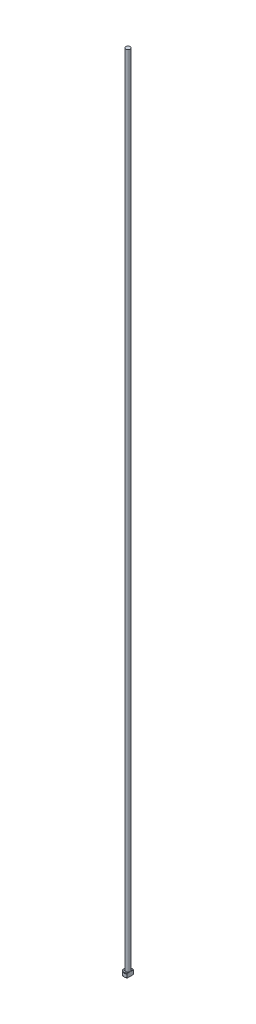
from build123d import *
from build123d.topology import SkipClean

# Parameters (mm, degrees)
CHAMFER1_SIZE = 0.2
FILLET1_R     = 0.2
KEY_DEPTH     = 401.009999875


with BuildPart() as part:
    # Sketch1 → Revolve1 (revolve)
    with BuildSketch(Plane.XY, mode=Mode.PRIVATE) as revolve1_sk:
        Polygon((0, 0), (-2, 0), (-2, 2), (-1.1, 2), (-1.1, 400), (0, 400), align=None)
    revolve(revolve1_sk.sketch.rotate(Axis((0, 259.958771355, 0), (0, -1, 0)), 270), axis=Axis((0, 259.958771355, 0), (0, -1, 0)))

    # Chamfer1
    chamfer1_edges = [part.edges().sort_by_distance(p)[0] for p in [
        (0, 2, -2),
        (0, 0, -2),
    ]]
    chamfer(chamfer1_edges, length=CHAMFER1_SIZE)

    # Fillet1
    fillet1_edges = [part.edges().sort_by_distance(p)[0] for p in [
        (0, 2, -1.1),
    ]]
    fillet(fillet1_edges, radius=FILLET1_R)

    # Sketch2 → KEY (cut, through all)
    with SkipClean():  # the faces are left unmerged after this step: merging them gives an invalid solid
        with BuildSketch(Plane(origin=(0, 0, 0), x_dir=(1, 0, 0), z_dir=(0, 1, 0))):
            with BuildLine():
                Line((1.1, 1.670329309), (1.1, -1.670329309))
                ThreePointArc((1.1, -1.670329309), (2, 0), (1.1, 1.670329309))
            make_face()
        extrude(amount=KEY_DEPTH, mode=Mode.SUBTRACT)


solid = part.part
